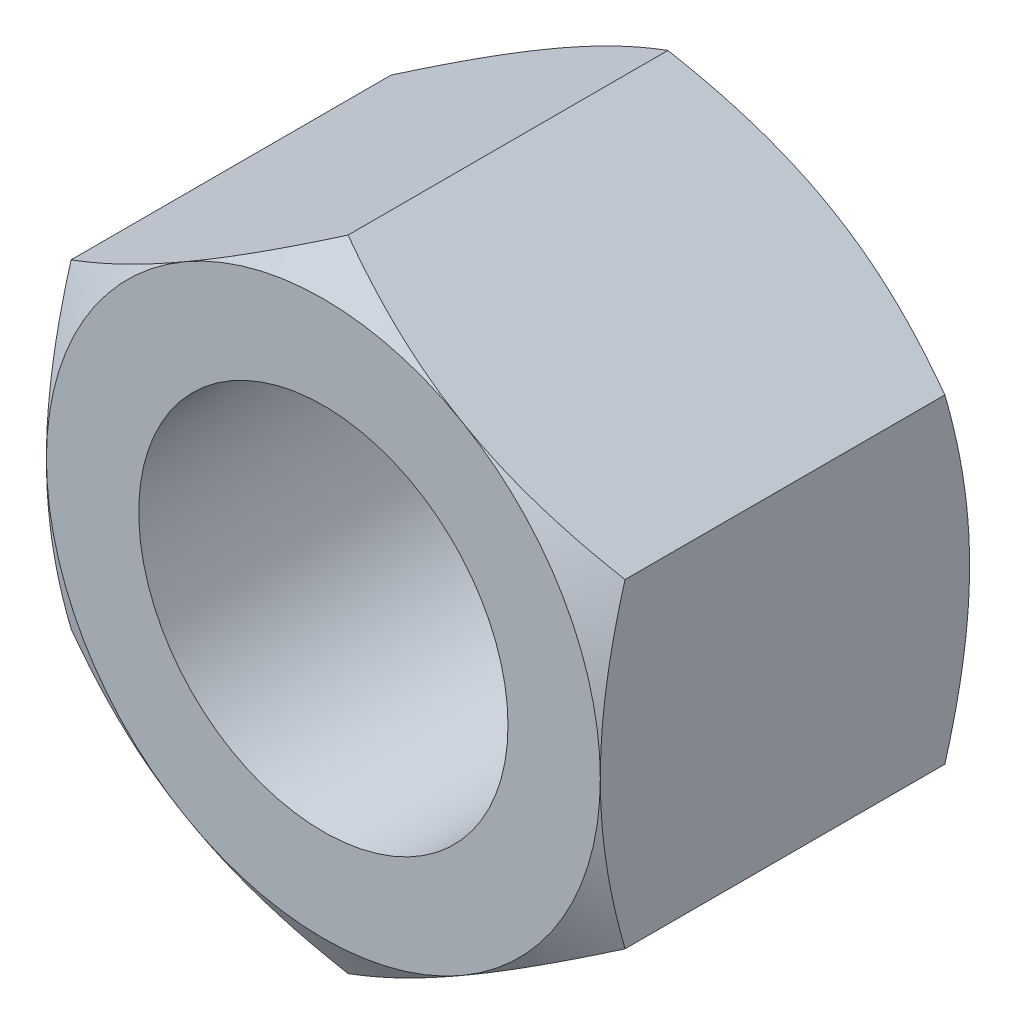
ISO-10303-21;
HEADER;
FILE_DESCRIPTION(('STEP AP214'),'2;1');
FILE_NAME('part.step','',(''),(''),'','','');
FILE_SCHEMA(('AUTOMOTIVE_DESIGN { 1 0 10303 214 1 1 1 1 }'));
ENDSEC;
DATA;
#1=APPLICATION_CONTEXT('core data for automotive mechanical design processes');
#2=APPLICATION_PROTOCOL_DEFINITION('international standard','automotive_design',2000,#1);
#3=PRODUCT_CONTEXT('',#1,'mechanical');
#4=PRODUCT('Part','Part','',(#3));
#5=PRODUCT_RELATED_PRODUCT_CATEGORY('part','',(#4));
#6=PRODUCT_DEFINITION_FORMATION('','',#4);
#7=PRODUCT_DEFINITION_CONTEXT('part definition',#1,'design');
#8=PRODUCT_DEFINITION('design','',#6,#7);
#9=PRODUCT_DEFINITION_SHAPE('','',#8);
#10=(LENGTH_UNIT() NAMED_UNIT(*) SI_UNIT(.MILLI.,.METRE.));
#11=(NAMED_UNIT(*) PLANE_ANGLE_UNIT() SI_UNIT($,.RADIAN.));
#12=(NAMED_UNIT(*) SI_UNIT($,.STERADIAN.) SOLID_ANGLE_UNIT());
#13=UNCERTAINTY_MEASURE_WITH_UNIT(LENGTH_MEASURE(1.E-05),#10,'distance_accuracy_value','');
#14=(GEOMETRIC_REPRESENTATION_CONTEXT(3) GLOBAL_UNCERTAINTY_ASSIGNED_CONTEXT((#13)) GLOBAL_UNIT_ASSIGNED_CONTEXT((#10,
#11,#12)) REPRESENTATION_CONTEXT('',''));
#15=CARTESIAN_POINT('',(0.,0.,0.));
#16=DIRECTION('',(0.,0.,1.));
#17=DIRECTION('',(1.,0.,0.));
#18=AXIS2_PLACEMENT_3D('',#15,#16,#17);
#19=CARTESIAN_POINT('',(-19.05,10.9985226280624,12.7));
#20=DIRECTION('',(0.,0.,1.));
#21=DIRECTION('',(1.,0.,0.));
#22=AXIS2_PLACEMENT_3D('',#19,#20,#21);
#23=PLANE('',#22);
#24=CARTESIAN_POINT('',(0.,0.,12.7));
#25=DIRECTION('',(0.,0.,1.));
#26=DIRECTION('',(1.,0.,0.));
#27=AXIS2_PLACEMENT_3D('',#24,#25,#26);
#28=CIRCLE('',#27,12.7);
#29=CARTESIAN_POINT('',(12.7,0.,12.7));
#30=VERTEX_POINT('',#29);
#31=EDGE_CURVE('E272',#30,#30,#28,.T.);
#32=ORIENTED_EDGE('',*,*,#31,.F.);
#33=EDGE_LOOP('',(#32));
#34=FACE_BOUND('',#33,.T.);
#35=CARTESIAN_POINT('',(0.,0.,12.7));
#36=DIRECTION('',(0.,0.,1.));
#37=DIRECTION('',(1.,0.,0.));
#38=AXIS2_PLACEMENT_3D('',#35,#36,#37);
#39=CIRCLE('',#38,19.05);
#40=CARTESIAN_POINT('',(9.52500000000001,-16.4977839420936,12.7));
#41=VERTEX_POINT('',#40);
#42=CARTESIAN_POINT('',(19.05,0.,12.7));
#43=VERTEX_POINT('',#42);
#44=EDGE_CURVE('E327',#41,#43,#39,.T.);
#45=ORIENTED_EDGE('',*,*,#44,.T.);
#46=CARTESIAN_POINT('',(9.525,16.4977839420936,12.7));
#47=VERTEX_POINT('',#46);
#48=EDGE_CURVE('E320',#43,#47,#39,.T.);
#49=ORIENTED_EDGE('',*,*,#48,.T.);
#50=CARTESIAN_POINT('',(-9.52500000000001,16.4977839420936,12.7));
#51=VERTEX_POINT('',#50);
#52=EDGE_CURVE('E321',#47,#51,#39,.T.);
#53=ORIENTED_EDGE('',*,*,#52,.T.);
#54=CARTESIAN_POINT('',(-19.05,0.,12.7));
#55=VERTEX_POINT('',#54);
#56=EDGE_CURVE('E326',#51,#55,#39,.T.);
#57=ORIENTED_EDGE('',*,*,#56,.T.);
#58=CARTESIAN_POINT('',(-9.52500000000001,-16.4977839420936,12.7));
#59=VERTEX_POINT('',#58);
#60=EDGE_CURVE('E338',#55,#59,#39,.T.);
#61=ORIENTED_EDGE('',*,*,#60,.T.);
#62=EDGE_CURVE('E334',#59,#41,#39,.T.);
#63=ORIENTED_EDGE('',*,*,#62,.T.);
#64=EDGE_LOOP('',(#45,#49,#53,#57,#61,#63));
#65=FACE_BOUND('',#64,.T.);
#66=ADVANCED_FACE('F47',(#34,#65),#23,.T.);
#67=CARTESIAN_POINT('',(0.,21.9970452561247,12.7));
#68=DIRECTION('',(0.5,-0.866025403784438,0.));
#69=DIRECTION('',(0.866025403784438,0.5,0.));
#70=AXIS2_PLACEMENT_3D('',#67,#68,#69);
#71=PLANE('',#70);
#72=DIRECTION('',(0.,0.,-1.));
#73=VECTOR('',#72,1.);
#74=CARTESIAN_POINT('',(0.,21.9970452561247,12.7));
#75=LINE('',#74,#73);
#76=CARTESIAN_POINT('',(0.,21.9970452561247,10.9985226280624));
#77=VERTEX_POINT('',#76);
#78=CARTESIAN_POINT('',(0.,21.9970452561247,-10.9985226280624));
#79=VERTEX_POINT('',#78);
#80=EDGE_CURVE('E280',#77,#79,#75,.T.);
#81=ORIENTED_EDGE('',*,*,#80,.T.);
#82=CARTESIAN_POINT('',(0.000199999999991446,21.9971607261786,-10.9984559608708));
#83=CARTESIAN_POINT('',(-0.418511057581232,21.7554177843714,-11.1380165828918));
#84=CARTESIAN_POINT('',(-0.838855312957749,21.5127319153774,-11.2712441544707));
#85=CARTESIAN_POINT('',(-1.68291448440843,21.0254141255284,-11.5232728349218));
#86=CARTESIAN_POINT('',(-2.10663046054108,20.7807815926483,-11.6420691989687));
#87=CARTESIAN_POINT('',(-2.95825197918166,20.2890976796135,-11.8636385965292));
#88=CARTESIAN_POINT('',(-3.38616497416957,20.0420419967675,-11.9663737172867));
#89=CARTESIAN_POINT('',(-4.24496432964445,19.5462139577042,-12.1536145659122));
#90=CARTESIAN_POINT('',(-4.67585051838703,19.2974417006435,-12.2381213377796));
#91=CARTESIAN_POINT('',(-5.52955551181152,18.8045548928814,-12.3853111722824));
#92=CARTESIAN_POINT('',(-5.95231093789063,18.5604769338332,-12.4484814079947));
#93=CARTESIAN_POINT('',(-6.799758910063,18.0712026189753,-12.5544036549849));
#94=CARTESIAN_POINT('',(-7.22445149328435,17.8260062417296,-12.5971552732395));
#95=CARTESIAN_POINT('',(-8.07455006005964,17.3352016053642,-12.6611608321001));
#96=CARTESIAN_POINT('',(-8.49995459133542,17.0895941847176,-12.6824403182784));
#97=CARTESIAN_POINT('',(-9.35115630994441,16.5981526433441,-12.703043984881));
#98=CARTESIAN_POINT('',(-9.77695348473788,16.3523185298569,-12.7023688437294));
#99=CARTESIAN_POINT('',(-10.5729903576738,15.8927264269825,-12.6805966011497));
#100=CARTESIAN_POINT('',(-10.9432867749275,15.6789356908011,-12.6621544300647));
#101=CARTESIAN_POINT('',(-11.6829963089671,15.2518641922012,-12.6090155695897));
#102=CARTESIAN_POINT('',(-12.0524094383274,15.0385834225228,-12.5743191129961));
#103=CARTESIAN_POINT('',(-12.7902124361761,14.612612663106,-12.4892737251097));
#104=CARTESIAN_POINT('',(-13.1586010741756,14.3999233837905,-12.4389106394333));
#105=CARTESIAN_POINT('',(-13.8936246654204,13.9755573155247,-12.3234206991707));
#106=CARTESIAN_POINT('',(-14.2602596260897,13.7638805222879,-12.2582939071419));
#107=CARTESIAN_POINT('',(-15.3732272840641,13.121308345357,-12.0391116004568));
#108=CARTESIAN_POINT('',(-16.116336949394,12.6922737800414,-11.8632008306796));
#109=CARTESIAN_POINT('',(-17.5914757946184,11.840601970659,-11.4639556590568));
#110=CARTESIAN_POINT('',(-18.3235238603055,11.4179538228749,-11.2407150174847));
#111=CARTESIAN_POINT('',(-19.0502,10.9984071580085,-10.9984559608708));
#112=B_SPLINE_CURVE_WITH_KNOTS('',3,(#82,#83,#84,#85,#86,#87,#88,#89,#90,#91,#92,#93,#94,#95,
#96,#97,#98,#99,#100,#101,#102,#103,#104,#105,#106,#107,#108,#109,#110,#111),.UNSPECIFIED.,.F.,
.F.,(4,2,2,2,2,2,2,2,2,2,2,2,2,2,4),(0.,1.50971559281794,3.01992622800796,4.53364959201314,
6.04728623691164,7.52356313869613,8.99986845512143,10.4744153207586,11.9489166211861,
13.2325441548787,14.5161533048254,15.8009255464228,17.085692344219,19.7118183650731,
22.3327898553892),.UNSPECIFIED.);
#113=CARTESIAN_POINT('',(-9.52500000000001,16.4977839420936,-12.7));
#114=VERTEX_POINT('',#113);
#115=EDGE_CURVE('E71',#79,#114,#112,.T.);
#116=ORIENTED_EDGE('',*,*,#115,.T.);
#117=CARTESIAN_POINT('',(-19.05,10.9985226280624,-10.9985226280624));
#118=VERTEX_POINT('',#117);
#119=EDGE_CURVE('E200',#114,#118,#112,.T.);
#120=ORIENTED_EDGE('',*,*,#119,.T.);
#121=DIRECTION('',(0.,0.,-1.));
#122=VECTOR('',#121,1.);
#123=CARTESIAN_POINT('',(-19.05,10.9985226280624,12.7));
#124=LINE('',#123,#122);
#125=CARTESIAN_POINT('',(-19.05,10.9985226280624,10.9985226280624));
#126=VERTEX_POINT('',#125);
#127=EDGE_CURVE('E296',#126,#118,#124,.T.);
#128=ORIENTED_EDGE('',*,*,#127,.F.);
#129=CARTESIAN_POINT('',(0.000199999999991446,21.9971607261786,10.9984559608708));
#130=CARTESIAN_POINT('',(-0.418511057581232,21.7554177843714,11.1380165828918));
#131=CARTESIAN_POINT('',(-0.838855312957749,21.5127319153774,11.2712441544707));
#132=CARTESIAN_POINT('',(-1.68291448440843,21.0254141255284,11.5232728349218));
#133=CARTESIAN_POINT('',(-2.10663046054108,20.7807815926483,11.6420691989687));
#134=CARTESIAN_POINT('',(-2.95825197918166,20.2890976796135,11.8636385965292));
#135=CARTESIAN_POINT('',(-3.38616497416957,20.0420419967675,11.9663737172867));
#136=CARTESIAN_POINT('',(-4.24496432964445,19.5462139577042,12.1536145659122));
#137=CARTESIAN_POINT('',(-4.67585051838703,19.2974417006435,12.2381213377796));
#138=CARTESIAN_POINT('',(-5.52955551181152,18.8045548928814,12.3853111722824));
#139=CARTESIAN_POINT('',(-5.95231093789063,18.5604769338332,12.4484814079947));
#140=CARTESIAN_POINT('',(-6.799758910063,18.0712026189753,12.5544036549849));
#141=CARTESIAN_POINT('',(-7.22445149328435,17.8260062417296,12.5971552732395));
#142=CARTESIAN_POINT('',(-8.07455006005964,17.3352016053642,12.6611608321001));
#143=CARTESIAN_POINT('',(-8.49995459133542,17.0895941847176,12.6824403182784));
#144=CARTESIAN_POINT('',(-9.35115630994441,16.5981526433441,12.703043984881));
#145=CARTESIAN_POINT('',(-9.77695348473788,16.3523185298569,12.7023688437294));
#146=CARTESIAN_POINT('',(-10.5729903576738,15.8927264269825,12.6805966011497));
#147=CARTESIAN_POINT('',(-10.9432867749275,15.6789356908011,12.6621544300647));
#148=CARTESIAN_POINT('',(-11.6829963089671,15.2518641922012,12.6090155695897));
#149=CARTESIAN_POINT('',(-12.0524094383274,15.0385834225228,12.5743191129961));
#150=CARTESIAN_POINT('',(-12.7902124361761,14.612612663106,12.4892737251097));
#151=CARTESIAN_POINT('',(-13.1586010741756,14.3999233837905,12.4389106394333));
#152=CARTESIAN_POINT('',(-13.8936246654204,13.9755573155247,12.3234206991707));
#153=CARTESIAN_POINT('',(-14.2602596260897,13.7638805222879,12.2582939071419));
#154=CARTESIAN_POINT('',(-15.3732272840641,13.121308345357,12.0391116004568));
#155=CARTESIAN_POINT('',(-16.116336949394,12.6922737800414,11.8632008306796));
#156=CARTESIAN_POINT('',(-17.5914757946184,11.840601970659,11.4639556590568));
#157=CARTESIAN_POINT('',(-18.3235238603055,11.4179538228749,11.2407150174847));
#158=CARTESIAN_POINT('',(-19.0502,10.9984071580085,10.9984559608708));
#159=B_SPLINE_CURVE_WITH_KNOTS('',3,(#129,#130,#131,#132,#133,#134,#135,#136,#137,#138,#139,
#140,#141,#142,#143,#144,#145,#146,#147,#148,#149,#150,#151,#152,#153,#154,#155,#156,#157,#158),
.UNSPECIFIED.,.F.,.F.,(4,2,2,2,2,2,2,2,2,2,2,2,2,2,4),(0.,1.50971559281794,3.01992622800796,
4.53364959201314,6.04728623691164,7.52356313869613,8.99986845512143,10.4744153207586,
11.9489166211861,13.2325441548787,14.5161533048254,15.8009255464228,17.085692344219,
19.7118183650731,22.3327898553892),.UNSPECIFIED.);
#160=EDGE_CURVE('E264',#51,#126,#159,.T.);
#161=ORIENTED_EDGE('',*,*,#160,.F.);
#162=EDGE_CURVE('E275',#77,#51,#159,.T.);
#163=ORIENTED_EDGE('',*,*,#162,.F.);
#164=EDGE_LOOP('',(#81,#116,#120,#128,#161,#163));
#165=FACE_BOUND('',#164,.T.);
#166=ADVANCED_FACE('F51',(#165),#71,.F.);
#167=CARTESIAN_POINT('',(-19.05,10.9985226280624,12.7));
#168=DIRECTION('',(1.,0.,0.));
#169=DIRECTION('',(0.,0.,-1.));
#170=AXIS2_PLACEMENT_3D('',#167,#168,#169);
#171=PLANE('',#170);
#172=ORIENTED_EDGE('',*,*,#127,.T.);
#173=CARTESIAN_POINT('',(-19.05,-29.704842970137,-3.32468159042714));
#174=CARTESIAN_POINT('',(-19.05,-29.2880176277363,-3.52725325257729));
#175=CARTESIAN_POINT('',(-19.05,-28.8707073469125,-3.72882660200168));
#176=CARTESIAN_POINT('',(-19.05,-28.0350157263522,-4.12975080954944));
#177=CARTESIAN_POINT('',(-19.05,-27.6166343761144,-4.32910164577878));
#178=CARTESIAN_POINT('',(-19.05,-26.3596225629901,-4.92353317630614));
#179=CARTESIAN_POINT('',(-19.05,-25.5192453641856,-5.31493391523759));
#180=CARTESIAN_POINT('',(-19.05,-23.8284249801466,-6.08765547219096));
#181=CARTESIAN_POINT('',(-19.05,-22.9779520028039,-6.46891125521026));
#182=CARTESIAN_POINT('',(-19.05,-21.2702956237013,-7.21603222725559));
#183=CARTESIAN_POINT('',(-19.05,-20.4131125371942,-7.58189813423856));
#184=CARTESIAN_POINT('',(-19.05,-18.6629590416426,-8.30563016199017));
#185=CARTESIAN_POINT('',(-19.05,-17.7697243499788,-8.66286047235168));
#186=CARTESIAN_POINT('',(-19.05,-15.9728600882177,-9.35067464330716));
#187=CARTESIAN_POINT('',(-19.05,-15.069229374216,-9.68125553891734));
#188=CARTESIAN_POINT('',(-19.05,-13.2518012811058,-10.3072096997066));
#189=CARTESIAN_POINT('',(-19.05,-12.3380281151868,-10.6026527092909));
#190=CARTESIAN_POINT('',(-19.05,-10.4972925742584,-11.1489779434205));
#191=CARTESIAN_POINT('',(-19.05,-9.5703343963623,-11.3998740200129));
#192=CARTESIAN_POINT('',(-19.05,-8.17225940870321,-11.7331611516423));
#193=CARTESIAN_POINT('',(-19.05,-7.70619354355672,-11.8368646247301));
#194=CARTESIAN_POINT('',(-19.05,-6.77084748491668,-12.0286789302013));
#195=CARTESIAN_POINT('',(-19.05,-6.30156735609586,-12.1167900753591));
#196=CARTESIAN_POINT('',(-19.05,-5.36011735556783,-12.2758723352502));
#197=CARTESIAN_POINT('',(-19.05,-4.88794761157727,-12.3468442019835));
#198=CARTESIAN_POINT('',(-19.05,-3.9411744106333,-12.4702438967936));
#199=CARTESIAN_POINT('',(-19.05,-3.46657095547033,-12.5226717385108));
#200=CARTESIAN_POINT('',(-19.05,-2.52188913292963,-12.6072706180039));
#201=CARTESIAN_POINT('',(-19.05,-2.05183411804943,-12.6397008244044));
#202=CARTESIAN_POINT('',(-19.05,-1.1107742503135,-12.6846456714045));
#203=CARTESIAN_POINT('',(-19.05,-0.639769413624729,-12.6971606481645));
#204=CARTESIAN_POINT('',(-19.05,0.302356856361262,-12.7019767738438));
#205=CARTESIAN_POINT('',(-19.05,0.773478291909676,-12.6942774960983));
#206=CARTESIAN_POINT('',(-19.05,1.71497323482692,-12.6588540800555));
#207=CARTESIAN_POINT('',(-19.05,2.18534670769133,-12.6311290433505));
#208=CARTESIAN_POINT('',(-19.05,3.31047160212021,-12.541452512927));
#209=CARTESIAN_POINT('',(-19.05,3.96450261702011,-12.4702968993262));
#210=CARTESIAN_POINT('',(-19.05,5.26782427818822,-12.2931018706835));
#211=CARTESIAN_POINT('',(-19.05,5.91711429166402,-12.1870578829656));
#212=CARTESIAN_POINT('',(-19.05,7.21027369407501,-11.9438580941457));
#213=CARTESIAN_POINT('',(-19.05,7.85413879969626,-11.806679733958));
#214=CARTESIAN_POINT('',(-19.05,9.13547019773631,-11.505399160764));
#215=CARTESIAN_POINT('',(-19.05,9.77293657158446,-11.3412972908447));
#216=CARTESIAN_POINT('',(-19.05,11.0565336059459,-10.9860009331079));
#217=CARTESIAN_POINT('',(-19.05,11.7025108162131,-10.7942558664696));
#218=CARTESIAN_POINT('',(-19.05,12.9880981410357,-10.3906028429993));
#219=CARTESIAN_POINT('',(-19.05,13.627708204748,-10.1786947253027));
#220=CARTESIAN_POINT('',(-19.05,14.9008928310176,-9.73810867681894));
#221=CARTESIAN_POINT('',(-19.05,15.5344691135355,-9.50943569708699));
#222=CARTESIAN_POINT('',(-19.05,16.4808648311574,-9.15589938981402));
#223=CARTESIAN_POINT('',(-19.05,16.7956663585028,-9.0363003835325));
#224=CARTESIAN_POINT('',(-19.05,17.4240291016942,-8.79388528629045));
#225=CARTESIAN_POINT('',(-19.05,17.7375903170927,-8.67106919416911));
#226=CARTESIAN_POINT('',(-19.05,18.6310385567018,-8.31627730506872));
#227=CARTESIAN_POINT('',(-19.05,19.2095039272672,-8.0807176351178));
#228=CARTESIAN_POINT('',(-19.05,20.3628726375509,-7.60101592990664));
#229=CARTESIAN_POINT('',(-19.05,20.9377758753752,-7.35687365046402));
#230=CARTESIAN_POINT('',(-19.05,22.0844706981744,-6.86124405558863));
#231=CARTESIAN_POINT('',(-19.05,22.6562619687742,-6.60975601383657));
#232=CARTESIAN_POINT('',(-19.05,23.7970456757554,-6.10050121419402));
#233=CARTESIAN_POINT('',(-19.05,24.3660380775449,-5.84273437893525));
#234=CARTESIAN_POINT('',(-19.05,25.5017820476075,-5.32168522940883));
#235=CARTESIAN_POINT('',(-19.05,26.0685325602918,-5.05840061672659));
#236=CARTESIAN_POINT('',(-19.05,27.1998338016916,-4.52714350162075));
#237=CARTESIAN_POINT('',(-19.05,27.7643845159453,-4.2591709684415));
#238=CARTESIAN_POINT('',(-19.05,29.4550502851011,-3.44919524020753));
#239=CARTESIAN_POINT('',(-19.05,30.5782488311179,-2.90110167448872));
#240=CARTESIAN_POINT('',(-19.05,32.820439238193,-1.79151894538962));
#241=CARTESIAN_POINT('',(-19.05,33.9394202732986,-1.23000798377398));
#242=CARTESIAN_POINT('',(-19.05,36.172439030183,-0.0972249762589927));
#243=CARTESIAN_POINT('',(-19.05,37.2864767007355,0.474047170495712));
#244=CARTESIAN_POINT('',(-19.05,39.5102621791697,1.62419052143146));
#245=CARTESIAN_POINT('',(-19.05,40.6200109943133,2.2030597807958));
#246=CARTESIAN_POINT('',(-19.05,42.836225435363,3.36703382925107));
#247=CARTESIAN_POINT('',(-19.05,43.9426910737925,3.95213859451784));
#248=CARTESIAN_POINT('',(-19.05,46.025774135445,5.05983507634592));
#249=CARTESIAN_POINT('',(-19.05,47.0026854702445,5.58187453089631));
#250=CARTESIAN_POINT('',(-19.05,48.9546981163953,6.62932758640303));
#251=CARTESIAN_POINT('',(-19.05,49.92979942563,7.15474119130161));
#252=CARTESIAN_POINT('',(-19.05,52.852925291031,8.73533697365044));
#253=CARTESIAN_POINT('',(-19.05,54.7986350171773,9.79480119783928));
#254=CARTESIAN_POINT('',(-19.05,57.7103100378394,11.3884574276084));
#255=CARTESIAN_POINT('',(-19.05,58.6780157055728,11.9194769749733));
#256=CARTESIAN_POINT('',(-19.05,60.6124159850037,12.9833558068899));
#257=CARTESIAN_POINT('',(-19.05,61.5791105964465,13.5162150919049));
#258=CARTESIAN_POINT('',(-19.05,63.511529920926,14.5834908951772));
#259=CARTESIAN_POINT('',(-19.05,64.4772547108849,15.1179072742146));
#260=CARTESIAN_POINT('',(-19.05,66.4079175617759,16.1881569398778));
#261=CARTESIAN_POINT('',(-19.05,67.3728556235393,16.723990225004));
#262=CARTESIAN_POINT('',(-19.05,68.3374509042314,17.2604393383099));
#263=B_SPLINE_CURVE_WITH_KNOTS('',3,(#173,#174,#175,#176,#177,#178,#179,#180,#181,#182,#183,
#184,#185,#186,#187,#188,#189,#190,#191,#192,#193,#194,#195,#196,#197,#198,#199,#200,#201,#202,
#203,#204,#205,#206,#207,#208,#209,#210,#211,#212,#213,#214,#215,#216,#217,#218,#219,#220,#221,
#222,#223,#224,#225,#226,#227,#228,#229,#230,#231,#232,#233,#234,#235,#236,#237,#238,#239,#240,
#241,#242,#243,#244,#245,#246,#247,#248,#249,#250,#251,#252,#253,#254,#255,#256,#257,#258,#259,
#260,#261,#262),.UNSPECIFIED.,.F.,.F.,(4,2,2,2,2,2,2,2,2,2,2,2,2,2,2,2,2,2,2,2,2,2,2,2,2,2,2,2,
2,2,2,2,2,2,2,2,2,2,2,2,2,2,2,2,4),(0.,1.39032403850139,2.78066176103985,5.56174107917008,
8.35768056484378,11.1534894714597,14.0392235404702,16.9252782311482,19.8055053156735,
22.6848352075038,24.1170083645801,25.5491527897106,26.981234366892,28.4133148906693,
29.8264225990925,31.2395064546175,32.6526201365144,34.0657972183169,36.0383819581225,
38.0112253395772,39.9855027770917,41.9597550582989,43.9808644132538,46.0019898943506,
48.0225208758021,49.032771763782,50.0430230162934,51.9166987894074,53.7904279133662,
55.6643429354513,57.5382810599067,59.4130159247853,61.2877630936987,65.0370266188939,
68.7928626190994,72.5487374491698,76.3036688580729,80.0585859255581,83.3815181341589,
86.7044542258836,93.3507913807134,96.6622741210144,99.9737576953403,103.284953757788,
106.596146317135),.UNSPECIFIED.);
#264=CARTESIAN_POINT('',(-19.05,0.,-12.7));
#265=VERTEX_POINT('',#264);
#266=EDGE_CURVE('E337',#118,#265,#263,.F.);
#267=ORIENTED_EDGE('',*,*,#266,.T.);
#268=CARTESIAN_POINT('',(-19.05,-10.9985226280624,-10.9985226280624));
#269=VERTEX_POINT('',#268);
#270=EDGE_CURVE('E228',#265,#269,#263,.F.);
#271=ORIENTED_EDGE('',*,*,#270,.T.);
#272=DIRECTION('',(0.,0.,-1.));
#273=VECTOR('',#272,1.);
#274=CARTESIAN_POINT('',(-19.05,-10.9985226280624,12.7));
#275=LINE('',#274,#273);
#276=CARTESIAN_POINT('',(-19.05,-10.9985226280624,10.9985226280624));
#277=VERTEX_POINT('',#276);
#278=EDGE_CURVE('E294',#277,#269,#275,.T.);
#279=ORIENTED_EDGE('',*,*,#278,.F.);
#280=CARTESIAN_POINT('',(-19.05,-29.704842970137,3.32468159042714));
#281=CARTESIAN_POINT('',(-19.05,-29.2880176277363,3.52725325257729));
#282=CARTESIAN_POINT('',(-19.05,-28.8707073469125,3.72882660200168));
#283=CARTESIAN_POINT('',(-19.05,-28.0350157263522,4.12975080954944));
#284=CARTESIAN_POINT('',(-19.05,-27.6166343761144,4.32910164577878));
#285=CARTESIAN_POINT('',(-19.05,-26.3596225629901,4.92353317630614));
#286=CARTESIAN_POINT('',(-19.05,-25.5192453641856,5.31493391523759));
#287=CARTESIAN_POINT('',(-19.05,-23.8284249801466,6.08765547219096));
#288=CARTESIAN_POINT('',(-19.05,-22.9779520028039,6.46891125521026));
#289=CARTESIAN_POINT('',(-19.05,-21.2702956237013,7.21603222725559));
#290=CARTESIAN_POINT('',(-19.05,-20.4131125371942,7.58189813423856));
#291=CARTESIAN_POINT('',(-19.05,-18.6629590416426,8.30563016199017));
#292=CARTESIAN_POINT('',(-19.05,-17.7697243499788,8.66286047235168));
#293=CARTESIAN_POINT('',(-19.05,-15.9728600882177,9.35067464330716));
#294=CARTESIAN_POINT('',(-19.05,-15.069229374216,9.68125553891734));
#295=CARTESIAN_POINT('',(-19.05,-13.2518012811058,10.3072096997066));
#296=CARTESIAN_POINT('',(-19.05,-12.3380281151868,10.6026527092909));
#297=CARTESIAN_POINT('',(-19.05,-10.4972925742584,11.1489779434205));
#298=CARTESIAN_POINT('',(-19.05,-9.5703343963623,11.3998740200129));
#299=CARTESIAN_POINT('',(-19.05,-8.17225940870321,11.7331611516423));
#300=CARTESIAN_POINT('',(-19.05,-7.70619354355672,11.8368646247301));
#301=CARTESIAN_POINT('',(-19.05,-6.77084748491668,12.0286789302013));
#302=CARTESIAN_POINT('',(-19.05,-6.30156735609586,12.1167900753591));
#303=CARTESIAN_POINT('',(-19.05,-5.36011735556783,12.2758723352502));
#304=CARTESIAN_POINT('',(-19.05,-4.88794761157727,12.3468442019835));
#305=CARTESIAN_POINT('',(-19.05,-3.9411744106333,12.4702438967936));
#306=CARTESIAN_POINT('',(-19.05,-3.46657095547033,12.5226717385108));
#307=CARTESIAN_POINT('',(-19.05,-2.52188913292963,12.6072706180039));
#308=CARTESIAN_POINT('',(-19.05,-2.05183411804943,12.6397008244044));
#309=CARTESIAN_POINT('',(-19.05,-1.1107742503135,12.6846456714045));
#310=CARTESIAN_POINT('',(-19.05,-0.639769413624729,12.6971606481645));
#311=CARTESIAN_POINT('',(-19.05,0.302356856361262,12.7019767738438));
#312=CARTESIAN_POINT('',(-19.05,0.773478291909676,12.6942774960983));
#313=CARTESIAN_POINT('',(-19.05,1.71497323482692,12.6588540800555));
#314=CARTESIAN_POINT('',(-19.05,2.18534670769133,12.6311290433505));
#315=CARTESIAN_POINT('',(-19.05,3.31047160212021,12.541452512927));
#316=CARTESIAN_POINT('',(-19.05,3.96450261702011,12.4702968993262));
#317=CARTESIAN_POINT('',(-19.05,5.26782427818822,12.2931018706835));
#318=CARTESIAN_POINT('',(-19.05,5.91711429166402,12.1870578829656));
#319=CARTESIAN_POINT('',(-19.05,7.21027369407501,11.9438580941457));
#320=CARTESIAN_POINT('',(-19.05,7.85413879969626,11.806679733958));
#321=CARTESIAN_POINT('',(-19.05,9.13547019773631,11.505399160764));
#322=CARTESIAN_POINT('',(-19.05,9.77293657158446,11.3412972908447));
#323=CARTESIAN_POINT('',(-19.05,11.0565336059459,10.9860009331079));
#324=CARTESIAN_POINT('',(-19.05,11.7025108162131,10.7942558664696));
#325=CARTESIAN_POINT('',(-19.05,12.9880981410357,10.3906028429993));
#326=CARTESIAN_POINT('',(-19.05,13.627708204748,10.1786947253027));
#327=CARTESIAN_POINT('',(-19.05,14.9008928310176,9.73810867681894));
#328=CARTESIAN_POINT('',(-19.05,15.5344691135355,9.50943569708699));
#329=CARTESIAN_POINT('',(-19.05,16.4808648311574,9.15589938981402));
#330=CARTESIAN_POINT('',(-19.05,16.7956663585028,9.0363003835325));
#331=CARTESIAN_POINT('',(-19.05,17.4240291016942,8.79388528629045));
#332=CARTESIAN_POINT('',(-19.05,17.7375903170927,8.67106919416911));
#333=CARTESIAN_POINT('',(-19.05,18.6310385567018,8.31627730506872));
#334=CARTESIAN_POINT('',(-19.05,19.2095039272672,8.0807176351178));
#335=CARTESIAN_POINT('',(-19.05,20.3628726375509,7.60101592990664));
#336=CARTESIAN_POINT('',(-19.05,20.9377758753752,7.35687365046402));
#337=CARTESIAN_POINT('',(-19.05,22.0844706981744,6.86124405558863));
#338=CARTESIAN_POINT('',(-19.05,22.6562619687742,6.60975601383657));
#339=CARTESIAN_POINT('',(-19.05,23.7970456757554,6.10050121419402));
#340=CARTESIAN_POINT('',(-19.05,24.3660380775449,5.84273437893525));
#341=CARTESIAN_POINT('',(-19.05,25.5017820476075,5.32168522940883));
#342=CARTESIAN_POINT('',(-19.05,26.0685325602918,5.05840061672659));
#343=CARTESIAN_POINT('',(-19.05,27.1998338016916,4.52714350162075));
#344=CARTESIAN_POINT('',(-19.05,27.7643845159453,4.2591709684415));
#345=CARTESIAN_POINT('',(-19.05,29.4550502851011,3.44919524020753));
#346=CARTESIAN_POINT('',(-19.05,30.5782488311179,2.90110167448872));
#347=CARTESIAN_POINT('',(-19.05,32.820439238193,1.79151894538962));
#348=CARTESIAN_POINT('',(-19.05,33.9394202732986,1.23000798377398));
#349=CARTESIAN_POINT('',(-19.05,36.172439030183,0.0972249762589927));
#350=CARTESIAN_POINT('',(-19.05,37.2864767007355,-0.474047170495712));
#351=CARTESIAN_POINT('',(-19.05,39.5102621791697,-1.62419052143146));
#352=CARTESIAN_POINT('',(-19.05,40.6200109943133,-2.2030597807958));
#353=CARTESIAN_POINT('',(-19.05,42.836225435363,-3.36703382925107));
#354=CARTESIAN_POINT('',(-19.05,43.9426910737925,-3.95213859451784));
#355=CARTESIAN_POINT('',(-19.05,46.025774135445,-5.05983507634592));
#356=CARTESIAN_POINT('',(-19.05,47.0026854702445,-5.58187453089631));
#357=CARTESIAN_POINT('',(-19.05,48.9546981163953,-6.62932758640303));
#358=CARTESIAN_POINT('',(-19.05,49.92979942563,-7.15474119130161));
#359=CARTESIAN_POINT('',(-19.05,52.852925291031,-8.73533697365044));
#360=CARTESIAN_POINT('',(-19.05,54.7986350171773,-9.79480119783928));
#361=CARTESIAN_POINT('',(-19.05,57.7103100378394,-11.3884574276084));
#362=CARTESIAN_POINT('',(-19.05,58.6780157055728,-11.9194769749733));
#363=CARTESIAN_POINT('',(-19.05,60.6124159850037,-12.9833558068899));
#364=CARTESIAN_POINT('',(-19.05,61.5791105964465,-13.5162150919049));
#365=CARTESIAN_POINT('',(-19.05,63.511529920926,-14.5834908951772));
#366=CARTESIAN_POINT('',(-19.05,64.4772547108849,-15.1179072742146));
#367=CARTESIAN_POINT('',(-19.05,66.4079175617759,-16.1881569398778));
#368=CARTESIAN_POINT('',(-19.05,67.3728556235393,-16.723990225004));
#369=CARTESIAN_POINT('',(-19.05,68.3374509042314,-17.2604393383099));
#370=B_SPLINE_CURVE_WITH_KNOTS('',3,(#280,#281,#282,#283,#284,#285,#286,#287,#288,#289,#290,
#291,#292,#293,#294,#295,#296,#297,#298,#299,#300,#301,#302,#303,#304,#305,#306,#307,#308,#309,
#310,#311,#312,#313,#314,#315,#316,#317,#318,#319,#320,#321,#322,#323,#324,#325,#326,#327,#328,
#329,#330,#331,#332,#333,#334,#335,#336,#337,#338,#339,#340,#341,#342,#343,#344,#345,#346,#347,
#348,#349,#350,#351,#352,#353,#354,#355,#356,#357,#358,#359,#360,#361,#362,#363,#364,#365,#366,
#367,#368,#369),.UNSPECIFIED.,.F.,.F.,(4,2,2,2,2,2,2,2,2,2,2,2,2,2,2,2,2,2,2,2,2,2,2,2,2,2,2,2,
2,2,2,2,2,2,2,2,2,2,2,2,2,2,2,2,4),(0.,1.39032403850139,2.78066176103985,5.56174107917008,
8.35768056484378,11.1534894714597,14.0392235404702,16.9252782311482,19.8055053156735,
22.6848352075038,24.1170083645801,25.5491527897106,26.981234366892,28.4133148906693,
29.8264225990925,31.2395064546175,32.6526201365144,34.0657972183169,36.0383819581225,
38.0112253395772,39.9855027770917,41.9597550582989,43.9808644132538,46.0019898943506,
48.0225208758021,49.032771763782,50.0430230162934,51.9166987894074,53.7904279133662,
55.6643429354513,57.5382810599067,59.4130159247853,61.2877630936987,65.0370266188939,
68.7928626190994,72.5487374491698,76.3036688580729,80.0585859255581,83.3815181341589,
86.7044542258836,93.3507913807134,96.6622741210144,99.9737576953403,103.284953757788,
106.596146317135),.UNSPECIFIED.);
#371=EDGE_CURVE('E260',#55,#277,#370,.F.);
#372=ORIENTED_EDGE('',*,*,#371,.F.);
#373=EDGE_CURVE('E262',#126,#55,#370,.F.);
#374=ORIENTED_EDGE('',*,*,#373,.F.);
#375=EDGE_LOOP('',(#172,#267,#271,#279,#372,#374));
#376=FACE_BOUND('',#375,.T.);
#377=ADVANCED_FACE('F235',(#376),#171,.F.);
#378=CARTESIAN_POINT('',(-19.05,-10.9985226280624,12.7));
#379=DIRECTION('',(0.5,0.866025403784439,0.));
#380=DIRECTION('',(-0.866025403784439,0.5,0.));
#381=AXIS2_PLACEMENT_3D('',#378,#379,#380);
#382=PLANE('',#381);
#383=ORIENTED_EDGE('',*,*,#278,.T.);
#384=CARTESIAN_POINT('',(-19.0502,-10.9984071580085,-10.9984559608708));
#385=CARTESIAN_POINT('',(-18.6314889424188,-11.2401500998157,-11.1380165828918));
#386=CARTESIAN_POINT('',(-18.2111446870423,-11.4828359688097,-11.2712441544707));
#387=CARTESIAN_POINT('',(-17.3670855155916,-11.9701537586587,-11.5232728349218));
#388=CARTESIAN_POINT('',(-16.9433695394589,-12.2147862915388,-11.6420691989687));
#389=CARTESIAN_POINT('',(-16.0917480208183,-12.7064702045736,-11.8636385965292));
#390=CARTESIAN_POINT('',(-15.6638350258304,-12.9535258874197,-11.9663737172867));
#391=CARTESIAN_POINT('',(-14.8050356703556,-13.449353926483,-12.1536145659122));
#392=CARTESIAN_POINT('',(-14.374149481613,-13.6981261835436,-12.2381213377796));
#393=CARTESIAN_POINT('',(-13.5204444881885,-14.1910129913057,-12.3853111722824));
#394=CARTESIAN_POINT('',(-13.0976890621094,-14.4350909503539,-12.4484814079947));
#395=CARTESIAN_POINT('',(-12.250241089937,-14.9243652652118,-12.5544036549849));
#396=CARTESIAN_POINT('',(-11.8255485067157,-15.1695616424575,-12.5971552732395));
#397=CARTESIAN_POINT('',(-10.9754499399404,-15.6603662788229,-12.6611608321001));
#398=CARTESIAN_POINT('',(-10.5500454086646,-15.9059736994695,-12.6824403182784));
#399=CARTESIAN_POINT('',(-9.6988436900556,-16.397415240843,-12.703043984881));
#400=CARTESIAN_POINT('',(-9.27304651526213,-16.6432493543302,-12.7023688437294));
#401=CARTESIAN_POINT('',(-8.47700964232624,-17.1028414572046,-12.6805966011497));
#402=CARTESIAN_POINT('',(-8.10671322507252,-17.316632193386,-12.6621544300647));
#403=CARTESIAN_POINT('',(-7.3670036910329,-17.7437036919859,-12.6090155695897));
#404=CARTESIAN_POINT('',(-6.99759056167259,-17.9569844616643,-12.5743191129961));
#405=CARTESIAN_POINT('',(-6.25978756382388,-18.3829552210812,-12.4892737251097));
#406=CARTESIAN_POINT('',(-5.89139892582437,-18.5956445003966,-12.4389106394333));
#407=CARTESIAN_POINT('',(-5.1563753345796,-19.0200105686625,-12.3234206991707));
#408=CARTESIAN_POINT('',(-4.7897403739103,-19.2316873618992,-12.2582939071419));
#409=CARTESIAN_POINT('',(-3.67677271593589,-19.8742595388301,-12.0391116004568));
#410=CARTESIAN_POINT('',(-2.93366305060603,-20.3032941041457,-11.8632008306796));
#411=CARTESIAN_POINT('',(-1.45852420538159,-21.1549659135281,-11.4639556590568));
#412=CARTESIAN_POINT('',(-0.726476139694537,-21.5776140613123,-11.2407150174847));
#413=CARTESIAN_POINT('',(0.000200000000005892,-21.9971607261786,-10.9984559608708));
#414=B_SPLINE_CURVE_WITH_KNOTS('',3,(#384,#385,#386,#387,#388,#389,#390,#391,#392,#393,#394,
#395,#396,#397,#398,#399,#400,#401,#402,#403,#404,#405,#406,#407,#408,#409,#410,#411,#412,#413),
.UNSPECIFIED.,.F.,.F.,(4,2,2,2,2,2,2,2,2,2,2,2,2,2,4),(0.,1.50971559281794,3.01992622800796,
4.53364959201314,6.04728623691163,7.52356313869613,8.99986845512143,10.4744153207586,
11.9489166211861,13.2325441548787,14.5161533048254,15.8009255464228,17.085692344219,
19.7118183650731,22.3327898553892),.UNSPECIFIED.);
#415=CARTESIAN_POINT('',(-9.525,-16.4977839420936,-12.7));
#416=VERTEX_POINT('',#415);
#417=EDGE_CURVE('E221',#269,#416,#414,.T.);
#418=ORIENTED_EDGE('',*,*,#417,.T.);
#419=CARTESIAN_POINT('',(0.,-21.9970452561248,-10.9985226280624));
#420=VERTEX_POINT('',#419);
#421=EDGE_CURVE('E216',#416,#420,#414,.T.);
#422=ORIENTED_EDGE('',*,*,#421,.T.);
#423=DIRECTION('',(0.,0.,-1.));
#424=VECTOR('',#423,1.);
#425=CARTESIAN_POINT('',(0.,-21.9970452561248,12.7));
#426=LINE('',#425,#424);
#427=CARTESIAN_POINT('',(0.,-21.9970452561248,10.9985226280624));
#428=VERTEX_POINT('',#427);
#429=EDGE_CURVE('E290',#428,#420,#426,.T.);
#430=ORIENTED_EDGE('',*,*,#429,.F.);
#431=CARTESIAN_POINT('',(-19.0502,-10.9984071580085,10.9984559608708));
#432=CARTESIAN_POINT('',(-18.6314889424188,-11.2401500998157,11.1380165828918));
#433=CARTESIAN_POINT('',(-18.2111446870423,-11.4828359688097,11.2712441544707));
#434=CARTESIAN_POINT('',(-17.3670855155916,-11.9701537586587,11.5232728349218));
#435=CARTESIAN_POINT('',(-16.9433695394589,-12.2147862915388,11.6420691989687));
#436=CARTESIAN_POINT('',(-16.0917480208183,-12.7064702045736,11.8636385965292));
#437=CARTESIAN_POINT('',(-15.6638350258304,-12.9535258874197,11.9663737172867));
#438=CARTESIAN_POINT('',(-14.8050356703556,-13.449353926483,12.1536145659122));
#439=CARTESIAN_POINT('',(-14.374149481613,-13.6981261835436,12.2381213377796));
#440=CARTESIAN_POINT('',(-13.5204444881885,-14.1910129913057,12.3853111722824));
#441=CARTESIAN_POINT('',(-13.0976890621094,-14.4350909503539,12.4484814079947));
#442=CARTESIAN_POINT('',(-12.250241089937,-14.9243652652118,12.5544036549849));
#443=CARTESIAN_POINT('',(-11.8255485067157,-15.1695616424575,12.5971552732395));
#444=CARTESIAN_POINT('',(-10.9754499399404,-15.6603662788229,12.6611608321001));
#445=CARTESIAN_POINT('',(-10.5500454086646,-15.9059736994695,12.6824403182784));
#446=CARTESIAN_POINT('',(-9.6988436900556,-16.397415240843,12.703043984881));
#447=CARTESIAN_POINT('',(-9.27304651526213,-16.6432493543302,12.7023688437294));
#448=CARTESIAN_POINT('',(-8.47700964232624,-17.1028414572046,12.6805966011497));
#449=CARTESIAN_POINT('',(-8.10671322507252,-17.316632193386,12.6621544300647));
#450=CARTESIAN_POINT('',(-7.3670036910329,-17.7437036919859,12.6090155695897));
#451=CARTESIAN_POINT('',(-6.99759056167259,-17.9569844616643,12.5743191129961));
#452=CARTESIAN_POINT('',(-6.25978756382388,-18.3829552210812,12.4892737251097));
#453=CARTESIAN_POINT('',(-5.89139892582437,-18.5956445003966,12.4389106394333));
#454=CARTESIAN_POINT('',(-5.1563753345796,-19.0200105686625,12.3234206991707));
#455=CARTESIAN_POINT('',(-4.7897403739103,-19.2316873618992,12.2582939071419));
#456=CARTESIAN_POINT('',(-3.67677271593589,-19.8742595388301,12.0391116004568));
#457=CARTESIAN_POINT('',(-2.93366305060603,-20.3032941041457,11.8632008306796));
#458=CARTESIAN_POINT('',(-1.45852420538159,-21.1549659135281,11.4639556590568));
#459=CARTESIAN_POINT('',(-0.726476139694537,-21.5776140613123,11.2407150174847));
#460=CARTESIAN_POINT('',(0.000200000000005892,-21.9971607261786,10.9984559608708));
#461=B_SPLINE_CURVE_WITH_KNOTS('',3,(#431,#432,#433,#434,#435,#436,#437,#438,#439,#440,#441,
#442,#443,#444,#445,#446,#447,#448,#449,#450,#451,#452,#453,#454,#455,#456,#457,#458,#459,#460),
.UNSPECIFIED.,.F.,.F.,(4,2,2,2,2,2,2,2,2,2,2,2,2,2,4),(0.,1.50971559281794,3.01992622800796,
4.53364959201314,6.04728623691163,7.52356313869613,8.99986845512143,10.4744153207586,
11.9489166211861,13.2325441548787,14.5161533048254,15.8009255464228,17.085692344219,
19.7118183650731,22.3327898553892),.UNSPECIFIED.);
#462=EDGE_CURVE('E243',#59,#428,#461,.T.);
#463=ORIENTED_EDGE('',*,*,#462,.F.);
#464=EDGE_CURVE('E248',#277,#59,#461,.T.);
#465=ORIENTED_EDGE('',*,*,#464,.F.);
#466=EDGE_LOOP('',(#383,#418,#422,#430,#463,#465));
#467=FACE_BOUND('',#466,.T.);
#468=ADVANCED_FACE('F231',(#467),#382,.F.);
#469=CARTESIAN_POINT('',(0.,-21.9970452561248,12.7));
#470=DIRECTION('',(-0.5,0.866025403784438,0.));
#471=DIRECTION('',(-0.866025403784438,-0.5,0.));
#472=AXIS2_PLACEMENT_3D('',#469,#470,#471);
#473=PLANE('',#472);
#474=ORIENTED_EDGE('',*,*,#429,.T.);
#475=CARTESIAN_POINT('',(-0.000199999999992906,-21.9971607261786,-10.9984559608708));
#476=CARTESIAN_POINT('',(0.418511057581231,-21.7554177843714,-11.1380165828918));
#477=CARTESIAN_POINT('',(0.838855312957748,-21.5127319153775,-11.2712441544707));
#478=CARTESIAN_POINT('',(1.68291448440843,-21.0254141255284,-11.5232728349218));
#479=CARTESIAN_POINT('',(2.10663046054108,-20.7807815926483,-11.6420691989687));
#480=CARTESIAN_POINT('',(2.95825197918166,-20.2890976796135,-11.8636385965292));
#481=CARTESIAN_POINT('',(3.38616497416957,-20.0420419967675,-11.9663737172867));
#482=CARTESIAN_POINT('',(4.24496432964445,-19.5462139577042,-12.1536145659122));
#483=CARTESIAN_POINT('',(4.67585051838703,-19.2974417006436,-12.2381213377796));
#484=CARTESIAN_POINT('',(5.52955551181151,-18.8045548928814,-12.3853111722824));
#485=CARTESIAN_POINT('',(5.95231093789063,-18.5604769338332,-12.4484814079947));
#486=CARTESIAN_POINT('',(6.799758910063,-18.0712026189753,-12.5544036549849));
#487=CARTESIAN_POINT('',(7.22445149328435,-17.8260062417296,-12.5971552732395));
#488=CARTESIAN_POINT('',(8.07455006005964,-17.3352016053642,-12.6611608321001));
#489=CARTESIAN_POINT('',(8.49995459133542,-17.0895941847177,-12.6824403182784));
#490=CARTESIAN_POINT('',(9.35115630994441,-16.5981526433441,-12.703043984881));
#491=CARTESIAN_POINT('',(9.77695348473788,-16.3523185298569,-12.7023688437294));
#492=CARTESIAN_POINT('',(10.5729903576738,-15.8927264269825,-12.6805966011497));
#493=CARTESIAN_POINT('',(10.9432867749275,-15.6789356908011,-12.6621544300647));
#494=CARTESIAN_POINT('',(11.6829963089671,-15.2518641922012,-12.6090155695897));
#495=CARTESIAN_POINT('',(12.0524094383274,-15.0385834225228,-12.5743191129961));
#496=CARTESIAN_POINT('',(12.7902124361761,-14.612612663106,-12.4892737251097));
#497=CARTESIAN_POINT('',(13.1586010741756,-14.3999233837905,-12.4389106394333));
#498=CARTESIAN_POINT('',(13.8936246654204,-13.9755573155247,-12.3234206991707));
#499=CARTESIAN_POINT('',(14.2602596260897,-13.7638805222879,-12.2582939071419));
#500=CARTESIAN_POINT('',(15.3732272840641,-13.121308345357,-12.0391116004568));
#501=CARTESIAN_POINT('',(16.116336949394,-12.6922737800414,-11.8632008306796));
#502=CARTESIAN_POINT('',(17.5914757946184,-11.840601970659,-11.4639556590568));
#503=CARTESIAN_POINT('',(18.3235238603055,-11.4179538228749,-11.2407150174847));
#504=CARTESIAN_POINT('',(19.0502,-10.9984071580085,-10.9984559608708));
#505=B_SPLINE_CURVE_WITH_KNOTS('',3,(#475,#476,#477,#478,#479,#480,#481,#482,#483,#484,#485,
#486,#487,#488,#489,#490,#491,#492,#493,#494,#495,#496,#497,#498,#499,#500,#501,#502,#503,#504),
.UNSPECIFIED.,.F.,.F.,(4,2,2,2,2,2,2,2,2,2,2,2,2,2,4),(0.,1.50971559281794,3.01992622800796,
4.53364959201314,6.04728623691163,7.52356313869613,8.99986845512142,10.4744153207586,
11.9489166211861,13.2325441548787,14.5161533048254,15.8009255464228,17.085692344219,
19.7118183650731,22.3327898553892),.UNSPECIFIED.);
#506=CARTESIAN_POINT('',(9.52500000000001,-16.4977839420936,-12.7));
#507=VERTEX_POINT('',#506);
#508=EDGE_CURVE('E223',#420,#507,#505,.T.);
#509=ORIENTED_EDGE('',*,*,#508,.T.);
#510=CARTESIAN_POINT('',(19.05,-10.9985226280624,-10.9985226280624));
#511=VERTEX_POINT('',#510);
#512=EDGE_CURVE('E207',#507,#511,#505,.T.);
#513=ORIENTED_EDGE('',*,*,#512,.T.);
#514=DIRECTION('',(0.,0.,-1.));
#515=VECTOR('',#514,1.);
#516=CARTESIAN_POINT('',(19.05,-10.9985226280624,12.7));
#517=LINE('',#516,#515);
#518=CARTESIAN_POINT('',(19.05,-10.9985226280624,10.9985226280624));
#519=VERTEX_POINT('',#518);
#520=EDGE_CURVE('E286',#519,#511,#517,.T.);
#521=ORIENTED_EDGE('',*,*,#520,.F.);
#522=CARTESIAN_POINT('',(-0.000199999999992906,-21.9971607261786,10.9984559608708));
#523=CARTESIAN_POINT('',(0.418511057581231,-21.7554177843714,11.1380165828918));
#524=CARTESIAN_POINT('',(0.838855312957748,-21.5127319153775,11.2712441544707));
#525=CARTESIAN_POINT('',(1.68291448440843,-21.0254141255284,11.5232728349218));
#526=CARTESIAN_POINT('',(2.10663046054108,-20.7807815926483,11.6420691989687));
#527=CARTESIAN_POINT('',(2.95825197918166,-20.2890976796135,11.8636385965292));
#528=CARTESIAN_POINT('',(3.38616497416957,-20.0420419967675,11.9663737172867));
#529=CARTESIAN_POINT('',(4.24496432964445,-19.5462139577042,12.1536145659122));
#530=CARTESIAN_POINT('',(4.67585051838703,-19.2974417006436,12.2381213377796));
#531=CARTESIAN_POINT('',(5.52955551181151,-18.8045548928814,12.3853111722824));
#532=CARTESIAN_POINT('',(5.95231093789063,-18.5604769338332,12.4484814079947));
#533=CARTESIAN_POINT('',(6.799758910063,-18.0712026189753,12.5544036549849));
#534=CARTESIAN_POINT('',(7.22445149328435,-17.8260062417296,12.5971552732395));
#535=CARTESIAN_POINT('',(8.07455006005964,-17.3352016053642,12.6611608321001));
#536=CARTESIAN_POINT('',(8.49995459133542,-17.0895941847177,12.6824403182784));
#537=CARTESIAN_POINT('',(9.35115630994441,-16.5981526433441,12.703043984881));
#538=CARTESIAN_POINT('',(9.77695348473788,-16.3523185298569,12.7023688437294));
#539=CARTESIAN_POINT('',(10.5729903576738,-15.8927264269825,12.6805966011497));
#540=CARTESIAN_POINT('',(10.9432867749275,-15.6789356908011,12.6621544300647));
#541=CARTESIAN_POINT('',(11.6829963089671,-15.2518641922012,12.6090155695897));
#542=CARTESIAN_POINT('',(12.0524094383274,-15.0385834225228,12.5743191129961));
#543=CARTESIAN_POINT('',(12.7902124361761,-14.612612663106,12.4892737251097));
#544=CARTESIAN_POINT('',(13.1586010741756,-14.3999233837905,12.4389106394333));
#545=CARTESIAN_POINT('',(13.8936246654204,-13.9755573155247,12.3234206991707));
#546=CARTESIAN_POINT('',(14.2602596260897,-13.7638805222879,12.2582939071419));
#547=CARTESIAN_POINT('',(15.3732272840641,-13.121308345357,12.0391116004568));
#548=CARTESIAN_POINT('',(16.116336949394,-12.6922737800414,11.8632008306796));
#549=CARTESIAN_POINT('',(17.5914757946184,-11.840601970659,11.4639556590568));
#550=CARTESIAN_POINT('',(18.3235238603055,-11.4179538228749,11.2407150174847));
#551=CARTESIAN_POINT('',(19.0502,-10.9984071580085,10.9984559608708));
#552=B_SPLINE_CURVE_WITH_KNOTS('',3,(#522,#523,#524,#525,#526,#527,#528,#529,#530,#531,#532,
#533,#534,#535,#536,#537,#538,#539,#540,#541,#542,#543,#544,#545,#546,#547,#548,#549,#550,#551),
.UNSPECIFIED.,.F.,.F.,(4,2,2,2,2,2,2,2,2,2,2,2,2,2,4),(0.,1.50971559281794,3.01992622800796,
4.53364959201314,6.04728623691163,7.52356313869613,8.99986845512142,10.4744153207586,
11.9489166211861,13.2325441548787,14.5161533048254,15.8009255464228,17.085692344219,
19.7118183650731,22.3327898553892),.UNSPECIFIED.);
#553=EDGE_CURVE('E253',#41,#519,#552,.T.);
#554=ORIENTED_EDGE('',*,*,#553,.F.);
#555=EDGE_CURVE('E250',#428,#41,#552,.T.);
#556=ORIENTED_EDGE('',*,*,#555,.F.);
#557=EDGE_LOOP('',(#474,#509,#513,#521,#554,#556));
#558=FACE_BOUND('',#557,.T.);
#559=ADVANCED_FACE('F233',(#558),#473,.F.);
#560=CARTESIAN_POINT('',(19.05,-10.9985226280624,12.7));
#561=DIRECTION('',(-1.,0.,0.));
#562=DIRECTION('',(0.,-1.,0.));
#563=AXIS2_PLACEMENT_3D('',#560,#561,#562);
#564=PLANE('',#563);
#565=ORIENTED_EDGE('',*,*,#520,.T.);
#566=CARTESIAN_POINT('',(19.05,-29.7048429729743,-3.32468158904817));
#567=CARTESIAN_POINT('',(19.05,-29.2880176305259,-3.52725325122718));
#568=CARTESIAN_POINT('',(19.05,-28.8707073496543,-3.7288266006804));
#569=CARTESIAN_POINT('',(19.05,-28.0350157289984,-4.12975080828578));
#570=CARTESIAN_POINT('',(19.05,-27.6166343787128,-4.32910164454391));
#571=CARTESIAN_POINT('',(19.05,-26.3596225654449,-4.92353317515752));
#572=CARTESIAN_POINT('',(19.05,-25.5192453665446,-5.31493391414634));
#573=CARTESIAN_POINT('',(19.05,-23.8284249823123,-6.08765547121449));
#574=CARTESIAN_POINT('',(19.05,-22.9779520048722,-6.4689112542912));
#575=CARTESIAN_POINT('',(19.05,-21.2702956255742,-7.21603222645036));
#576=CARTESIAN_POINT('',(19.05,-20.413112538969,-7.58189813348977));
#577=CARTESIAN_POINT('',(19.05,-18.6629590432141,-8.30563016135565));
#578=CARTESIAN_POINT('',(19.05,-17.7697243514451,-8.66286047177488));
#579=CARTESIAN_POINT('',(19.05,-15.9728600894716,-9.3506746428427));
#580=CARTESIAN_POINT('',(19.05,-15.069229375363,-9.68125553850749));
#581=CARTESIAN_POINT('',(19.05,-13.2518012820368,-10.3072096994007));
#582=CARTESIAN_POINT('',(19.05,-12.3380281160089,-10.6026527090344));
#583=CARTESIAN_POINT('',(19.05,-10.4972925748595,-11.1489779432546));
#584=CARTESIAN_POINT('',(19.05,-9.57033439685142,-11.3998740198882));
#585=CARTESIAN_POINT('',(19.05,-8.17225940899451,-11.7331611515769));
#586=CARTESIAN_POINT('',(19.05,-7.70619354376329,-11.8368646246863));
#587=CARTESIAN_POINT('',(19.05,-6.77084748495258,-12.0286789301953));
#588=CARTESIAN_POINT('',(19.05,-6.30156735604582,-12.1167900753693));
#589=CARTESIAN_POINT('',(19.05,-5.36011735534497,-12.2758723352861));
#590=CARTESIAN_POINT('',(19.05,-4.88794761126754,-12.3468442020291));
#591=CARTESIAN_POINT('',(19.05,-3.94117441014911,-12.4702438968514));
#592=CARTESIAN_POINT('',(19.05,-3.46657095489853,-12.5226717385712));
#593=CARTESIAN_POINT('',(19.05,-2.52188913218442,-12.6072706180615));
#594=CARTESIAN_POINT('',(19.05,-2.05183411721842,-12.639700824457));
#595=CARTESIAN_POINT('',(19.05,-1.11077424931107,-12.6846456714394));
#596=CARTESIAN_POINT('',(19.05,-0.639769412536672,-12.6971606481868));
#597=CARTESIAN_POINT('',(19.05,0.302356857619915,-12.7019767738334));
#598=CARTESIAN_POINT('',(19.05,0.773478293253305,-12.6942774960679));
#599=CARTESIAN_POINT('',(19.05,1.71497323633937,-12.6588540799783));
#600=CARTESIAN_POINT('',(19.05,2.18534670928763,-12.6311290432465));
#601=CARTESIAN_POINT('',(19.05,3.31047160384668,-12.541452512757));
#602=CARTESIAN_POINT('',(19.05,3.96450261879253,-12.4702968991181));
#603=CARTESIAN_POINT('',(19.05,5.26782428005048,-12.2931018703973));
#604=CARTESIAN_POINT('',(19.05,5.91711429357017,-12.1870578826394));
#605=CARTESIAN_POINT('',(19.05,7.21027369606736,-11.9438580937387));
#606=CARTESIAN_POINT('',(19.05,7.85413880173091,-11.8066797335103));
#607=CARTESIAN_POINT('',(19.05,9.13547019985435,-11.5053991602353));
#608=CARTESIAN_POINT('',(19.05,9.77293657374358,-11.3412972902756));
#609=CARTESIAN_POINT('',(19.05,11.0565336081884,-10.9860009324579));
#610=CARTESIAN_POINT('',(19.05,11.7025108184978,-10.794255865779));
#611=CARTESIAN_POINT('',(19.05,12.9880981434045,-10.3906028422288));
#612=CARTESIAN_POINT('',(19.05,13.6277082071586,-10.1786947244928));
#613=CARTESIAN_POINT('',(19.05,14.9008928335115,-9.73810867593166));
#614=CARTESIAN_POINT('',(19.05,15.5344691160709,-9.50943569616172));
#615=CARTESIAN_POINT('',(19.05,16.4808648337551,-9.15589938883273));
#616=CARTESIAN_POINT('',(19.05,16.7956663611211,-9.0363003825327));
#617=CARTESIAN_POINT('',(19.05,17.4240291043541,-8.79388528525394));
#618=CARTESIAN_POINT('',(19.05,17.7375903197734,-8.67106919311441));
#619=CARTESIAN_POINT('',(19.05,18.6310385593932,-8.31627730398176));
#620=CARTESIAN_POINT('',(19.05,19.209503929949,-8.08071763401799));
#621=CARTESIAN_POINT('',(19.05,20.3628726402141,-7.60101592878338));
#622=CARTESIAN_POINT('',(19.05,20.9377758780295,-7.35687364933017));
#623=CARTESIAN_POINT('',(19.05,22.0844707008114,-6.86124405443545));
#624=CARTESIAN_POINT('',(19.05,22.6562619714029,-6.60975601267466));
#625=CARTESIAN_POINT('',(19.05,23.797045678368,-6.1005012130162));
#626=CARTESIAN_POINT('',(19.05,24.3660380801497,-5.84273437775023));
#627=CARTESIAN_POINT('',(19.05,25.5017820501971,-5.32168522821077));
#628=CARTESIAN_POINT('',(19.05,26.068532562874,-5.05840061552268));
#629=CARTESIAN_POINT('',(19.05,27.1998338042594,-4.52714350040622));
#630=CARTESIAN_POINT('',(19.05,27.7643845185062,-4.25917096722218));
#631=CARTESIAN_POINT('',(19.05,29.4550502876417,-3.44919523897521));
#632=CARTESIAN_POINT('',(19.05,30.5782488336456,-2.90110167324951));
#633=CARTESIAN_POINT('',(19.05,32.8204392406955,-1.79151894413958));
#634=CARTESIAN_POINT('',(19.05,33.9394202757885,-1.23000798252));
#635=CARTESIAN_POINT('',(19.05,36.1724390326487,-0.0972249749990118));
#636=CARTESIAN_POINT('',(19.05,37.2864767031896,0.474047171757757));
#637=CARTESIAN_POINT('',(19.05,39.5102621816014,1.62419052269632));
#638=CARTESIAN_POINT('',(19.05,40.6200109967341,2.20305978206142));
#639=CARTESIAN_POINT('',(19.05,42.8362254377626,3.36703383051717));
#640=CARTESIAN_POINT('',(19.05,43.9426910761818,3.95213859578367));
#641=CARTESIAN_POINT('',(19.05,46.025774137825,5.05983507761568));
#642=CARTESIAN_POINT('',(19.05,47.0026854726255,5.58187453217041));
#643=CARTESIAN_POINT('',(19.05,48.9546981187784,6.62932758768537));
#644=CARTESIAN_POINT('',(19.05,49.9297994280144,7.15474119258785));
#645=CARTESIAN_POINT('',(19.05,52.8529252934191,8.73533697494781));
#646=CARTESIAN_POINT('',(19.05,54.7986350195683,9.79480119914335));
#647=CARTESIAN_POINT('',(19.05,57.7103100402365,11.3884574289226));
#648=CARTESIAN_POINT('',(19.05,58.6780157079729,11.9194769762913));
#649=CARTESIAN_POINT('',(19.05,60.6124159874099,12.9833558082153));
#650=CARTESIAN_POINT('',(19.05,61.5791105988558,13.5162150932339));
#651=CARTESIAN_POINT('',(19.05,63.5115299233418,14.5834908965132));
#652=CARTESIAN_POINT('',(19.05,64.4772547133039,15.117907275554));
#653=CARTESIAN_POINT('',(19.05,66.4079175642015,16.188156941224));
#654=CARTESIAN_POINT('',(19.05,67.3728556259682,16.7239902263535));
#655=CARTESIAN_POINT('',(19.05,68.3374509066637,17.2604393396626));
#656=B_SPLINE_CURVE_WITH_KNOTS('',3,(#566,#567,#568,#569,#570,#571,#572,#573,#574,#575,#576,
#577,#578,#579,#580,#581,#582,#583,#584,#585,#586,#587,#588,#589,#590,#591,#592,#593,#594,#595,
#596,#597,#598,#599,#600,#601,#602,#603,#604,#605,#606,#607,#608,#609,#610,#611,#612,#613,#614,
#615,#616,#617,#618,#619,#620,#621,#622,#623,#624,#625,#626,#627,#628,#629,#630,#631,#632,#633,
#634,#635,#636,#637,#638,#639,#640,#641,#642,#643,#644,#645,#646,#647,#648,#649,#650,#651,#652,
#653,#654,#655),.UNSPECIFIED.,.F.,.F.,(4,2,2,2,2,2,2,2,2,2,2,2,2,2,2,2,2,2,2,2,2,2,2,2,2,2,2,2,
2,2,2,2,2,2,2,2,2,2,2,2,2,2,2,2,4),(0.,1.39032403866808,2.78066176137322,5.56174107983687,
8.35768056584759,11.1534894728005,14.0392235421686,16.9252782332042,19.805505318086,
22.6848352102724,24.1170083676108,25.5491527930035,26.9812343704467,28.4133148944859,
29.8264226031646,31.2395064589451,32.6526201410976,34.0657972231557,36.0383819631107,
38.0112253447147,39.9855027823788,41.9597550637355,43.9808644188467,46.0019899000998,
48.0225208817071,49.0327717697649,50.0430230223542,51.9166987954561,53.7904279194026,
55.6643429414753,57.5382810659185,59.4130159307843,61.287763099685,65.0370266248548,
68.792862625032,72.5487374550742,76.3036688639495,80.058585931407,83.3815181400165,
86.7044542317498,93.3507913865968,96.6622741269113,99.9737577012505,103.284953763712,
106.596146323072),.UNSPECIFIED.);
#657=CARTESIAN_POINT('',(19.05,0.,-12.7));
#658=VERTEX_POINT('',#657);
#659=EDGE_CURVE('E171',#511,#658,#656,.T.);
#660=ORIENTED_EDGE('',*,*,#659,.T.);
#661=CARTESIAN_POINT('',(19.05,10.9985226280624,-10.9985226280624));
#662=VERTEX_POINT('',#661);
#663=EDGE_CURVE('E152',#658,#662,#656,.T.);
#664=ORIENTED_EDGE('',*,*,#663,.T.);
#665=DIRECTION('',(0.,0.,-1.));
#666=VECTOR('',#665,1.);
#667=CARTESIAN_POINT('',(19.05,10.9985226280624,12.7));
#668=LINE('',#667,#666);
#669=CARTESIAN_POINT('',(19.05,10.9985226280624,10.9985226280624));
#670=VERTEX_POINT('',#669);
#671=EDGE_CURVE('E168',#670,#662,#668,.T.);
#672=ORIENTED_EDGE('',*,*,#671,.F.);
#673=CARTESIAN_POINT('',(19.05,-29.7048429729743,3.32468158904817));
#674=CARTESIAN_POINT('',(19.05,-29.2880176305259,3.52725325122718));
#675=CARTESIAN_POINT('',(19.05,-28.8707073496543,3.7288266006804));
#676=CARTESIAN_POINT('',(19.05,-28.0350157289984,4.12975080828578));
#677=CARTESIAN_POINT('',(19.05,-27.6166343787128,4.32910164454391));
#678=CARTESIAN_POINT('',(19.05,-26.3596225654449,4.92353317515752));
#679=CARTESIAN_POINT('',(19.05,-25.5192453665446,5.31493391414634));
#680=CARTESIAN_POINT('',(19.05,-23.8284249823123,6.08765547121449));
#681=CARTESIAN_POINT('',(19.05,-22.9779520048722,6.4689112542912));
#682=CARTESIAN_POINT('',(19.05,-21.2702956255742,7.21603222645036));
#683=CARTESIAN_POINT('',(19.05,-20.413112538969,7.58189813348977));
#684=CARTESIAN_POINT('',(19.05,-18.6629590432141,8.30563016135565));
#685=CARTESIAN_POINT('',(19.05,-17.7697243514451,8.66286047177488));
#686=CARTESIAN_POINT('',(19.05,-15.9728600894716,9.3506746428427));
#687=CARTESIAN_POINT('',(19.05,-15.069229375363,9.68125553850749));
#688=CARTESIAN_POINT('',(19.05,-13.2518012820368,10.3072096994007));
#689=CARTESIAN_POINT('',(19.05,-12.3380281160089,10.6026527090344));
#690=CARTESIAN_POINT('',(19.05,-10.4972925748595,11.1489779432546));
#691=CARTESIAN_POINT('',(19.05,-9.57033439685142,11.3998740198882));
#692=CARTESIAN_POINT('',(19.05,-8.17225940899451,11.7331611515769));
#693=CARTESIAN_POINT('',(19.05,-7.70619354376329,11.8368646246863));
#694=CARTESIAN_POINT('',(19.05,-6.77084748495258,12.0286789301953));
#695=CARTESIAN_POINT('',(19.05,-6.30156735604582,12.1167900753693));
#696=CARTESIAN_POINT('',(19.05,-5.36011735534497,12.2758723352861));
#697=CARTESIAN_POINT('',(19.05,-4.88794761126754,12.3468442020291));
#698=CARTESIAN_POINT('',(19.05,-3.94117441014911,12.4702438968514));
#699=CARTESIAN_POINT('',(19.05,-3.46657095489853,12.5226717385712));
#700=CARTESIAN_POINT('',(19.05,-2.52188913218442,12.6072706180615));
#701=CARTESIAN_POINT('',(19.05,-2.05183411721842,12.639700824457));
#702=CARTESIAN_POINT('',(19.05,-1.11077424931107,12.6846456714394));
#703=CARTESIAN_POINT('',(19.05,-0.639769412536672,12.6971606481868));
#704=CARTESIAN_POINT('',(19.05,0.302356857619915,12.7019767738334));
#705=CARTESIAN_POINT('',(19.05,0.773478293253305,12.6942774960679));
#706=CARTESIAN_POINT('',(19.05,1.71497323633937,12.6588540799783));
#707=CARTESIAN_POINT('',(19.05,2.18534670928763,12.6311290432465));
#708=CARTESIAN_POINT('',(19.05,3.31047160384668,12.541452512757));
#709=CARTESIAN_POINT('',(19.05,3.96450261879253,12.4702968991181));
#710=CARTESIAN_POINT('',(19.05,5.26782428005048,12.2931018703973));
#711=CARTESIAN_POINT('',(19.05,5.91711429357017,12.1870578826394));
#712=CARTESIAN_POINT('',(19.05,7.21027369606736,11.9438580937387));
#713=CARTESIAN_POINT('',(19.05,7.85413880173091,11.8066797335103));
#714=CARTESIAN_POINT('',(19.05,9.13547019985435,11.5053991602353));
#715=CARTESIAN_POINT('',(19.05,9.77293657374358,11.3412972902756));
#716=CARTESIAN_POINT('',(19.05,11.0565336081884,10.9860009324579));
#717=CARTESIAN_POINT('',(19.05,11.7025108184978,10.794255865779));
#718=CARTESIAN_POINT('',(19.05,12.9880981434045,10.3906028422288));
#719=CARTESIAN_POINT('',(19.05,13.6277082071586,10.1786947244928));
#720=CARTESIAN_POINT('',(19.05,14.9008928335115,9.73810867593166));
#721=CARTESIAN_POINT('',(19.05,15.5344691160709,9.50943569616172));
#722=CARTESIAN_POINT('',(19.05,16.4808648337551,9.15589938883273));
#723=CARTESIAN_POINT('',(19.05,16.7956663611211,9.0363003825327));
#724=CARTESIAN_POINT('',(19.05,17.4240291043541,8.79388528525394));
#725=CARTESIAN_POINT('',(19.05,17.7375903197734,8.67106919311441));
#726=CARTESIAN_POINT('',(19.05,18.6310385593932,8.31627730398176));
#727=CARTESIAN_POINT('',(19.05,19.209503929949,8.08071763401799));
#728=CARTESIAN_POINT('',(19.05,20.3628726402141,7.60101592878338));
#729=CARTESIAN_POINT('',(19.05,20.9377758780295,7.35687364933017));
#730=CARTESIAN_POINT('',(19.05,22.0844707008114,6.86124405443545));
#731=CARTESIAN_POINT('',(19.05,22.6562619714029,6.60975601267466));
#732=CARTESIAN_POINT('',(19.05,23.797045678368,6.1005012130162));
#733=CARTESIAN_POINT('',(19.05,24.3660380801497,5.84273437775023));
#734=CARTESIAN_POINT('',(19.05,25.5017820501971,5.32168522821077));
#735=CARTESIAN_POINT('',(19.05,26.068532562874,5.05840061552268));
#736=CARTESIAN_POINT('',(19.05,27.1998338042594,4.52714350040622));
#737=CARTESIAN_POINT('',(19.05,27.7643845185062,4.25917096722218));
#738=CARTESIAN_POINT('',(19.05,29.4550502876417,3.44919523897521));
#739=CARTESIAN_POINT('',(19.05,30.5782488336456,2.90110167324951));
#740=CARTESIAN_POINT('',(19.05,32.8204392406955,1.79151894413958));
#741=CARTESIAN_POINT('',(19.05,33.9394202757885,1.23000798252));
#742=CARTESIAN_POINT('',(19.05,36.1724390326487,0.0972249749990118));
#743=CARTESIAN_POINT('',(19.05,37.2864767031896,-0.474047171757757));
#744=CARTESIAN_POINT('',(19.05,39.5102621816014,-1.62419052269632));
#745=CARTESIAN_POINT('',(19.05,40.6200109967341,-2.20305978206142));
#746=CARTESIAN_POINT('',(19.05,42.8362254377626,-3.36703383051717));
#747=CARTESIAN_POINT('',(19.05,43.9426910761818,-3.95213859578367));
#748=CARTESIAN_POINT('',(19.05,46.025774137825,-5.05983507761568));
#749=CARTESIAN_POINT('',(19.05,47.0026854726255,-5.58187453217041));
#750=CARTESIAN_POINT('',(19.05,48.9546981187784,-6.62932758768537));
#751=CARTESIAN_POINT('',(19.05,49.9297994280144,-7.15474119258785));
#752=CARTESIAN_POINT('',(19.05,52.8529252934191,-8.73533697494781));
#753=CARTESIAN_POINT('',(19.05,54.7986350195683,-9.79480119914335));
#754=CARTESIAN_POINT('',(19.05,57.7103100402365,-11.3884574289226));
#755=CARTESIAN_POINT('',(19.05,58.6780157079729,-11.9194769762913));
#756=CARTESIAN_POINT('',(19.05,60.6124159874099,-12.9833558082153));
#757=CARTESIAN_POINT('',(19.05,61.5791105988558,-13.5162150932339));
#758=CARTESIAN_POINT('',(19.05,63.5115299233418,-14.5834908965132));
#759=CARTESIAN_POINT('',(19.05,64.4772547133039,-15.117907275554));
#760=CARTESIAN_POINT('',(19.05,66.4079175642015,-16.188156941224));
#761=CARTESIAN_POINT('',(19.05,67.3728556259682,-16.7239902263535));
#762=CARTESIAN_POINT('',(19.05,68.3374509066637,-17.2604393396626));
#763=B_SPLINE_CURVE_WITH_KNOTS('',3,(#673,#674,#675,#676,#677,#678,#679,#680,#681,#682,#683,
#684,#685,#686,#687,#688,#689,#690,#691,#692,#693,#694,#695,#696,#697,#698,#699,#700,#701,#702,
#703,#704,#705,#706,#707,#708,#709,#710,#711,#712,#713,#714,#715,#716,#717,#718,#719,#720,#721,
#722,#723,#724,#725,#726,#727,#728,#729,#730,#731,#732,#733,#734,#735,#736,#737,#738,#739,#740,
#741,#742,#743,#744,#745,#746,#747,#748,#749,#750,#751,#752,#753,#754,#755,#756,#757,#758,#759,
#760,#761,#762),.UNSPECIFIED.,.F.,.F.,(4,2,2,2,2,2,2,2,2,2,2,2,2,2,2,2,2,2,2,2,2,2,2,2,2,2,2,2,
2,2,2,2,2,2,2,2,2,2,2,2,2,2,2,2,4),(0.,1.39032403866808,2.78066176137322,5.56174107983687,
8.35768056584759,11.1534894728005,14.0392235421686,16.9252782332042,19.805505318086,
22.6848352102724,24.1170083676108,25.5491527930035,26.9812343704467,28.4133148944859,
29.8264226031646,31.2395064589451,32.6526201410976,34.0657972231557,36.0383819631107,
38.0112253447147,39.9855027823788,41.9597550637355,43.9808644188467,46.0019899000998,
48.0225208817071,49.0327717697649,50.0430230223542,51.9166987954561,53.7904279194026,
55.6643429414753,57.5382810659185,59.4130159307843,61.287763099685,65.0370266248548,
68.792862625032,72.5487374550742,76.3036688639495,80.058585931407,83.3815181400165,
86.7044542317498,93.3507913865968,96.6622741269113,99.9737577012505,103.284953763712,
106.596146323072),.UNSPECIFIED.);
#764=EDGE_CURVE('E317',#43,#670,#763,.T.);
#765=ORIENTED_EDGE('',*,*,#764,.F.);
#766=EDGE_CURVE('E332',#519,#43,#763,.T.);
#767=ORIENTED_EDGE('',*,*,#766,.F.);
#768=EDGE_LOOP('',(#565,#660,#664,#672,#765,#767));
#769=FACE_BOUND('',#768,.T.);
#770=ADVANCED_FACE('F371',(#769),#564,.F.);
#771=CARTESIAN_POINT('',(19.05,10.9985226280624,12.7));
#772=DIRECTION('',(-0.5,-0.866025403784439,0.));
#773=DIRECTION('',(0.866025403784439,-0.5,0.));
#774=AXIS2_PLACEMENT_3D('',#771,#772,#773);
#775=PLANE('',#774);
#776=ORIENTED_EDGE('',*,*,#671,.T.);
#777=CARTESIAN_POINT('',(19.0502,10.9984071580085,-10.9984559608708));
#778=CARTESIAN_POINT('',(18.6314889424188,11.2401500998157,-11.1380165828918));
#779=CARTESIAN_POINT('',(18.2111446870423,11.4828359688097,-11.2712441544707));
#780=CARTESIAN_POINT('',(17.3670855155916,11.9701537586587,-11.5232728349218));
#781=CARTESIAN_POINT('',(16.9433695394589,12.2147862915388,-11.6420691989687));
#782=CARTESIAN_POINT('',(16.0917480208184,12.7064702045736,-11.8636385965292));
#783=CARTESIAN_POINT('',(15.6638350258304,12.9535258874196,-11.9663737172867));
#784=CARTESIAN_POINT('',(14.8050356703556,13.4493539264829,-12.1536145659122));
#785=CARTESIAN_POINT('',(14.374149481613,13.6981261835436,-12.2381213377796));
#786=CARTESIAN_POINT('',(13.5204444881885,14.1910129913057,-12.3853111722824));
#787=CARTESIAN_POINT('',(13.0976890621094,14.4350909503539,-12.4484814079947));
#788=CARTESIAN_POINT('',(12.250241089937,14.9243652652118,-12.5544036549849));
#789=CARTESIAN_POINT('',(11.8255485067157,15.1695616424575,-12.5971552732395));
#790=CARTESIAN_POINT('',(10.9754499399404,15.6603662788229,-12.6611608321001));
#791=CARTESIAN_POINT('',(10.5500454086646,15.9059736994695,-12.6824403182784));
#792=CARTESIAN_POINT('',(9.6988436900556,16.397415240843,-12.703043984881));
#793=CARTESIAN_POINT('',(9.27304651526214,16.6432493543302,-12.7023688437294));
#794=CARTESIAN_POINT('',(8.47700964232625,17.1028414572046,-12.6805966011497));
#795=CARTESIAN_POINT('',(8.10671322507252,17.316632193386,-12.6621544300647));
#796=CARTESIAN_POINT('',(7.36700369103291,17.7437036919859,-12.6090155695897));
#797=CARTESIAN_POINT('',(6.99759056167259,17.9569844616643,-12.5743191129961));
#798=CARTESIAN_POINT('',(6.25978756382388,18.3829552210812,-12.4892737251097));
#799=CARTESIAN_POINT('',(5.89139892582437,18.5956445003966,-12.4389106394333));
#800=CARTESIAN_POINT('',(5.1563753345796,19.0200105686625,-12.3234206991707));
#801=CARTESIAN_POINT('',(4.7897403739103,19.2316873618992,-12.2582939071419));
#802=CARTESIAN_POINT('',(3.67677271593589,19.8742595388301,-12.0391116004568));
#803=CARTESIAN_POINT('',(2.93366305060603,20.3032941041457,-11.8632008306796));
#804=CARTESIAN_POINT('',(1.45852420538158,21.1549659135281,-11.4639556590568));
#805=CARTESIAN_POINT('',(0.726476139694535,21.5776140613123,-11.2407150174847));
#806=CARTESIAN_POINT('',(-0.000200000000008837,21.9971607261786,-10.9984559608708));
#807=B_SPLINE_CURVE_WITH_KNOTS('',3,(#777,#778,#779,#780,#781,#782,#783,#784,#785,#786,#787,
#788,#789,#790,#791,#792,#793,#794,#795,#796,#797,#798,#799,#800,#801,#802,#803,#804,#805,#806),
.UNSPECIFIED.,.F.,.F.,(4,2,2,2,2,2,2,2,2,2,2,2,2,2,4),(0.,1.50971559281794,3.01992622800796,
4.53364959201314,6.04728623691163,7.52356313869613,8.99986845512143,10.4744153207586,
11.9489166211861,13.2325441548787,14.5161533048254,15.8009255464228,17.085692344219,
19.7118183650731,22.3327898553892),.UNSPECIFIED.);
#808=CARTESIAN_POINT('',(9.525,16.4977839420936,-12.7));
#809=VERTEX_POINT('',#808);
#810=EDGE_CURVE('E150',#662,#809,#807,.T.);
#811=ORIENTED_EDGE('',*,*,#810,.T.);
#812=EDGE_CURVE('E137',#809,#79,#807,.T.);
#813=ORIENTED_EDGE('',*,*,#812,.T.);
#814=ORIENTED_EDGE('',*,*,#80,.F.);
#815=CARTESIAN_POINT('',(19.0502,10.9984071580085,10.9984559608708));
#816=CARTESIAN_POINT('',(18.6314889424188,11.2401500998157,11.1380165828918));
#817=CARTESIAN_POINT('',(18.2111446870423,11.4828359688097,11.2712441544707));
#818=CARTESIAN_POINT('',(17.3670855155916,11.9701537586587,11.5232728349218));
#819=CARTESIAN_POINT('',(16.9433695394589,12.2147862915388,11.6420691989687));
#820=CARTESIAN_POINT('',(16.0917480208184,12.7064702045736,11.8636385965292));
#821=CARTESIAN_POINT('',(15.6638350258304,12.9535258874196,11.9663737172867));
#822=CARTESIAN_POINT('',(14.8050356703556,13.4493539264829,12.1536145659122));
#823=CARTESIAN_POINT('',(14.374149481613,13.6981261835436,12.2381213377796));
#824=CARTESIAN_POINT('',(13.5204444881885,14.1910129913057,12.3853111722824));
#825=CARTESIAN_POINT('',(13.0976890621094,14.4350909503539,12.4484814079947));
#826=CARTESIAN_POINT('',(12.250241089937,14.9243652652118,12.5544036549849));
#827=CARTESIAN_POINT('',(11.8255485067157,15.1695616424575,12.5971552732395));
#828=CARTESIAN_POINT('',(10.9754499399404,15.6603662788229,12.6611608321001));
#829=CARTESIAN_POINT('',(10.5500454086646,15.9059736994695,12.6824403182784));
#830=CARTESIAN_POINT('',(9.6988436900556,16.397415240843,12.703043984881));
#831=CARTESIAN_POINT('',(9.27304651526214,16.6432493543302,12.7023688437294));
#832=CARTESIAN_POINT('',(8.47700964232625,17.1028414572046,12.6805966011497));
#833=CARTESIAN_POINT('',(8.10671322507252,17.316632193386,12.6621544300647));
#834=CARTESIAN_POINT('',(7.36700369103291,17.7437036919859,12.6090155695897));
#835=CARTESIAN_POINT('',(6.99759056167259,17.9569844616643,12.5743191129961));
#836=CARTESIAN_POINT('',(6.25978756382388,18.3829552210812,12.4892737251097));
#837=CARTESIAN_POINT('',(5.89139892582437,18.5956445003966,12.4389106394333));
#838=CARTESIAN_POINT('',(5.1563753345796,19.0200105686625,12.3234206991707));
#839=CARTESIAN_POINT('',(4.7897403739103,19.2316873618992,12.2582939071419));
#840=CARTESIAN_POINT('',(3.67677271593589,19.8742595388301,12.0391116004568));
#841=CARTESIAN_POINT('',(2.93366305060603,20.3032941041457,11.8632008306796));
#842=CARTESIAN_POINT('',(1.45852420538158,21.1549659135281,11.4639556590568));
#843=CARTESIAN_POINT('',(0.726476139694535,21.5776140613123,11.2407150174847));
#844=CARTESIAN_POINT('',(-0.000200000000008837,21.9971607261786,10.9984559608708));
#845=B_SPLINE_CURVE_WITH_KNOTS('',3,(#815,#816,#817,#818,#819,#820,#821,#822,#823,#824,#825,
#826,#827,#828,#829,#830,#831,#832,#833,#834,#835,#836,#837,#838,#839,#840,#841,#842,#843,#844),
.UNSPECIFIED.,.F.,.F.,(4,2,2,2,2,2,2,2,2,2,2,2,2,2,4),(0.,1.50971559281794,3.01992622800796,
4.53364959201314,6.04728623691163,7.52356313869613,8.99986845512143,10.4744153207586,
11.9489166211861,13.2325441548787,14.5161533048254,15.8009255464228,17.085692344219,
19.7118183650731,22.3327898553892),.UNSPECIFIED.);
#846=EDGE_CURVE('E301',#47,#77,#845,.T.);
#847=ORIENTED_EDGE('',*,*,#846,.F.);
#848=EDGE_CURVE('E164',#670,#47,#845,.T.);
#849=ORIENTED_EDGE('',*,*,#848,.F.);
#850=EDGE_LOOP('',(#776,#811,#813,#814,#847,#849));
#851=FACE_BOUND('',#850,.T.);
#852=ADVANCED_FACE('F170',(#851),#775,.F.);
#853=CARTESIAN_POINT('',(-19.05,10.9985226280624,-12.7));
#854=DIRECTION('',(0.,0.,1.));
#855=DIRECTION('',(1.,0.,0.));
#856=AXIS2_PLACEMENT_3D('',#853,#854,#855);
#857=PLANE('',#856);
#858=CARTESIAN_POINT('',(0.,0.,-12.7));
#859=DIRECTION('',(0.,0.,1.));
#860=DIRECTION('',(1.,0.,0.));
#861=AXIS2_PLACEMENT_3D('',#858,#859,#860);
#862=CIRCLE('',#861,19.05);
#863=EDGE_CURVE('E146',#658,#809,#862,.T.);
#864=ORIENTED_EDGE('',*,*,#863,.F.);
#865=CARTESIAN_POINT('',(0.,0.,-12.7));
#866=DIRECTION('',(0.,0.,1.));
#867=DIRECTION('',(1.,0.,0.));
#868=AXIS2_PLACEMENT_3D('',#865,#866,#867);
#869=CIRCLE('',#868,19.05);
#870=EDGE_CURVE('E12',#658,#507,#869,.F.);
#871=ORIENTED_EDGE('',*,*,#870,.T.);
#872=EDGE_CURVE('E56',#507,#416,#869,.F.);
#873=ORIENTED_EDGE('',*,*,#872,.T.);
#874=EDGE_CURVE('E352',#416,#265,#869,.F.);
#875=ORIENTED_EDGE('',*,*,#874,.T.);
#876=EDGE_CURVE('E162',#265,#114,#869,.F.);
#877=ORIENTED_EDGE('',*,*,#876,.T.);
#878=EDGE_CURVE('E58',#114,#809,#869,.F.);
#879=ORIENTED_EDGE('',*,*,#878,.T.);
#880=EDGE_LOOP('',(#864,#871,#873,#875,#877,#879));
#881=FACE_BOUND('',#880,.T.);
#882=CARTESIAN_POINT('',(0.,0.,-12.7));
#883=DIRECTION('',(0.,0.,1.));
#884=DIRECTION('',(1.,0.,0.));
#885=AXIS2_PLACEMENT_3D('',#882,#883,#884);
#886=CIRCLE('',#885,12.7);
#887=CARTESIAN_POINT('',(12.7,0.,-12.7));
#888=VERTEX_POINT('',#887);
#889=EDGE_CURVE('E279',#888,#888,#886,.T.);
#890=ORIENTED_EDGE('',*,*,#889,.T.);
#891=EDGE_LOOP('',(#890));
#892=FACE_BOUND('',#891,.T.);
#893=ADVANCED_FACE('F157',(#881,#892),#857,.F.);
#894=CARTESIAN_POINT('',(0.,0.,12.7));
#895=DIRECTION('',(0.,0.,-1.));
#896=DIRECTION('',(-1.,0.,0.));
#897=AXIS2_PLACEMENT_3D('',#894,#895,#896);
#898=CYLINDRICAL_SURFACE('',#897,12.7);
#899=ORIENTED_EDGE('',*,*,#31,.T.);
#900=EDGE_LOOP('',(#899));
#901=FACE_BOUND('',#900,.T.);
#902=ORIENTED_EDGE('',*,*,#889,.F.);
#903=EDGE_LOOP('',(#902));
#904=FACE_BOUND('',#903,.T.);
#905=ADVANCED_FACE('F386',(#901,#904),#898,.F.);
#906=CARTESIAN_POINT('',(0.,0.,12.7));
#907=DIRECTION('',(0.,0.,-1.));
#908=DIRECTION('',(1.,0.,0.));
#909=AXIS2_PLACEMENT_3D('',#906,#907,#908);
#910=CONICAL_SURFACE('',#909,19.05,1.0471975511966);
#911=ORIENTED_EDGE('',*,*,#162,.T.);
#912=ORIENTED_EDGE('',*,*,#52,.F.);
#913=ORIENTED_EDGE('',*,*,#846,.T.);
#914=EDGE_LOOP('',(#911,#912,#913));
#915=FACE_BOUND('',#914,.T.);
#916=ADVANCED_FACE('F194',(#915),#910,.T.);
#917=ORIENTED_EDGE('',*,*,#764,.T.);
#918=ORIENTED_EDGE('',*,*,#848,.T.);
#919=ORIENTED_EDGE('',*,*,#48,.F.);
#920=EDGE_LOOP('',(#917,#918,#919));
#921=FACE_BOUND('',#920,.T.);
#922=ADVANCED_FACE('F312',(#921),#910,.T.);
#923=ORIENTED_EDGE('',*,*,#553,.T.);
#924=ORIENTED_EDGE('',*,*,#766,.T.);
#925=ORIENTED_EDGE('',*,*,#44,.F.);
#926=EDGE_LOOP('',(#923,#924,#925));
#927=FACE_BOUND('',#926,.T.);
#928=ADVANCED_FACE('F468',(#927),#910,.T.);
#929=ORIENTED_EDGE('',*,*,#462,.T.);
#930=ORIENTED_EDGE('',*,*,#555,.T.);
#931=ORIENTED_EDGE('',*,*,#62,.F.);
#932=EDGE_LOOP('',(#929,#930,#931));
#933=FACE_BOUND('',#932,.T.);
#934=ADVANCED_FACE('F465',(#933),#910,.T.);
#935=ORIENTED_EDGE('',*,*,#371,.T.);
#936=ORIENTED_EDGE('',*,*,#464,.T.);
#937=ORIENTED_EDGE('',*,*,#60,.F.);
#938=EDGE_LOOP('',(#935,#936,#937));
#939=FACE_BOUND('',#938,.T.);
#940=ADVANCED_FACE('F423',(#939),#910,.T.);
#941=ORIENTED_EDGE('',*,*,#160,.T.);
#942=ORIENTED_EDGE('',*,*,#373,.T.);
#943=ORIENTED_EDGE('',*,*,#56,.F.);
#944=EDGE_LOOP('',(#941,#942,#943));
#945=FACE_BOUND('',#944,.T.);
#946=ADVANCED_FACE('F377',(#945),#910,.T.);
#947=CARTESIAN_POINT('',(0.,0.,-12.7));
#948=DIRECTION('',(0.,0.,1.));
#949=DIRECTION('',(1.,0.,0.));
#950=AXIS2_PLACEMENT_3D('',#947,#948,#949);
#951=CONICAL_SURFACE('',#950,19.05,1.0471975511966);
#952=ORIENTED_EDGE('',*,*,#863,.T.);
#953=ORIENTED_EDGE('',*,*,#810,.F.);
#954=ORIENTED_EDGE('',*,*,#663,.F.);
#955=EDGE_LOOP('',(#952,#953,#954));
#956=FACE_BOUND('',#955,.T.);
#957=ADVANCED_FACE('F155',(#956),#951,.T.);
#958=ORIENTED_EDGE('',*,*,#812,.F.);
#959=ORIENTED_EDGE('',*,*,#878,.F.);
#960=ORIENTED_EDGE('',*,*,#115,.F.);
#961=EDGE_LOOP('',(#958,#959,#960));
#962=FACE_BOUND('',#961,.T.);
#963=ADVANCED_FACE('F138',(#962),#951,.T.);
#964=ORIENTED_EDGE('',*,*,#876,.F.);
#965=ORIENTED_EDGE('',*,*,#266,.F.);
#966=ORIENTED_EDGE('',*,*,#119,.F.);
#967=EDGE_LOOP('',(#964,#965,#966));
#968=FACE_BOUND('',#967,.T.);
#969=ADVANCED_FACE('F192',(#968),#951,.T.);
#970=ORIENTED_EDGE('',*,*,#874,.F.);
#971=ORIENTED_EDGE('',*,*,#417,.F.);
#972=ORIENTED_EDGE('',*,*,#270,.F.);
#973=EDGE_LOOP('',(#970,#971,#972));
#974=FACE_BOUND('',#973,.T.);
#975=ADVANCED_FACE('F354',(#974),#951,.T.);
#976=ORIENTED_EDGE('',*,*,#872,.F.);
#977=ORIENTED_EDGE('',*,*,#508,.F.);
#978=ORIENTED_EDGE('',*,*,#421,.F.);
#979=EDGE_LOOP('',(#976,#977,#978));
#980=FACE_BOUND('',#979,.T.);
#981=ADVANCED_FACE('F361',(#980),#951,.T.);
#982=ORIENTED_EDGE('',*,*,#870,.F.);
#983=ORIENTED_EDGE('',*,*,#659,.F.);
#984=ORIENTED_EDGE('',*,*,#512,.F.);
#985=EDGE_LOOP('',(#982,#983,#984));
#986=FACE_BOUND('',#985,.T.);
#987=ADVANCED_FACE('F373',(#986),#951,.T.);
#988=CLOSED_SHELL('',(#66,#166,#377,#468,#559,#770,#852,#893,#905,#916,#922,#928,#934,#940,#946,
#957,#963,#969,#975,#981,#987));
#989=MANIFOLD_SOLID_BREP('B2',#988);
#990=ADVANCED_BREP_SHAPE_REPRESENTATION('',(#18,#989),#14);
#991=SHAPE_DEFINITION_REPRESENTATION(#9,#990);
ENDSEC;
END-ISO-10303-21;
